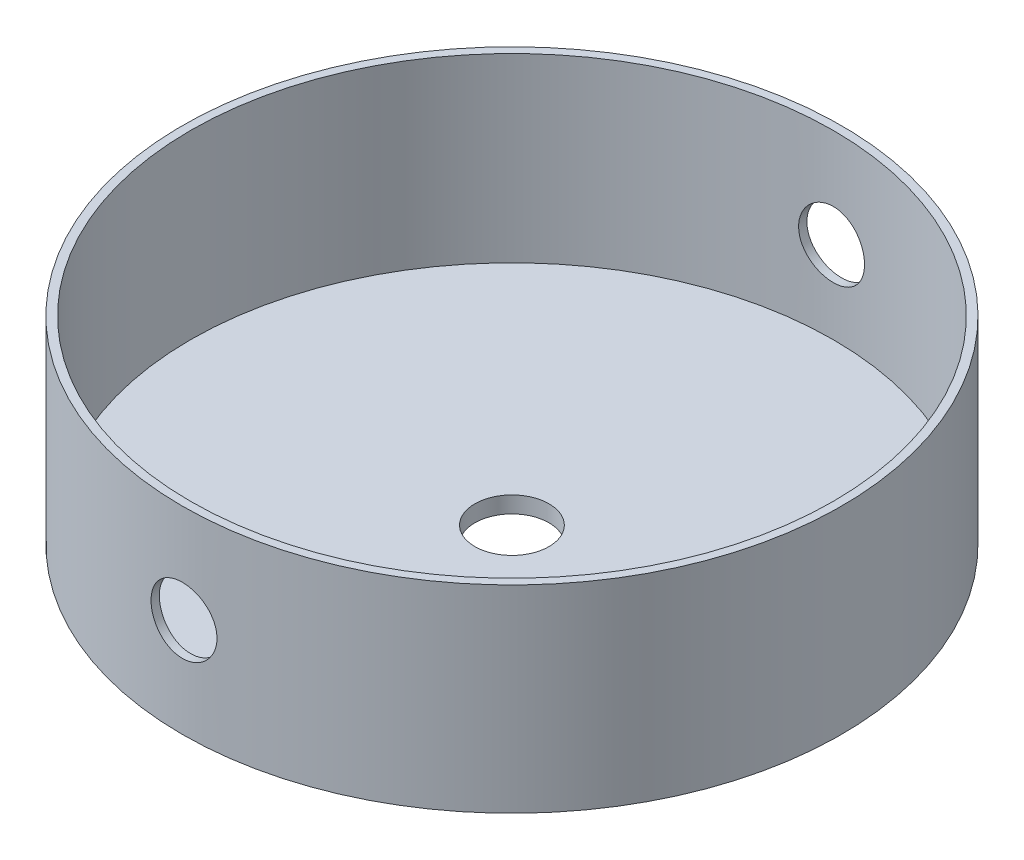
from build123d import *

# Parameters (mm, degrees)
CROQUIS1_R                 = 40
SALIENTE_EXTRUIR1_DEPTH    = 2
CROQUIS2_R                 = 40
CROQUIS2_R_2               = 39
SALIENTE_EXTRUIR2_DEPTH    = 22
CORTAR_EXTRUIR1_DEPTH      = 62.449165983
CORTAR_EXTRUIR1_DEPTH_BACK = 62.449165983
CROQUIS3_R                 = 4
CROQUIS4_R                 = 4.5
CORTAR_EXTRUIR2_DEPTH      = 22


with BuildPart() as part:
    # Croquis1 → Saliente-Extruir1 (new body)
    with BuildSketch(Plane(origin=(0, 0, 0), x_dir=(1, 0, 0), z_dir=(0, 1, 0))):
        with Locations(Location((0, 0, 0), (0, 0, 270))):
            Circle(CROQUIS1_R)
    extrude(amount=SALIENTE_EXTRUIR1_DEPTH)

    # Croquis2 → Saliente-Extruir2 (add)
    with BuildSketch(Plane(origin=(0, 2, 0), x_dir=(1, 0, 0), z_dir=(0, 1, 0))):
        with Locations(Location((0, 0, 0), (0, 0, 270))):
            Circle(CROQUIS2_R)
        with Locations(Location((0, 0, 0), (0, 0, 270))):
            Circle(CROQUIS2_R_2, mode=Mode.SUBTRACT)
    extrude(amount=SALIENTE_EXTRUIR2_DEPTH)

    # Croquis3 → Cortar-Extruir1 (cut, two sides: drawn at the far end of the back side and taken through both)
    with BuildSketch(Plane.XY.offset(-CORTAR_EXTRUIR1_DEPTH_BACK)):
        with Locations((0, 12)):
            Circle(CROQUIS3_R)
    extrude(amount=CORTAR_EXTRUIR1_DEPTH + CORTAR_EXTRUIR1_DEPTH_BACK, mode=Mode.SUBTRACT)

    # Croquis4 → Cortar-Extruir2 (cut)
    with BuildSketch(Plane(origin=(0, 2, 0), x_dir=(1, 0, 0), z_dir=(0, 1, 0))):
        with Locations(Location((0, 0, 0), (0, 0, 270))):
            Circle(CROQUIS4_R)
    extrude(amount=-CORTAR_EXTRUIR2_DEPTH, mode=Mode.SUBTRACT)


solid = part.part
